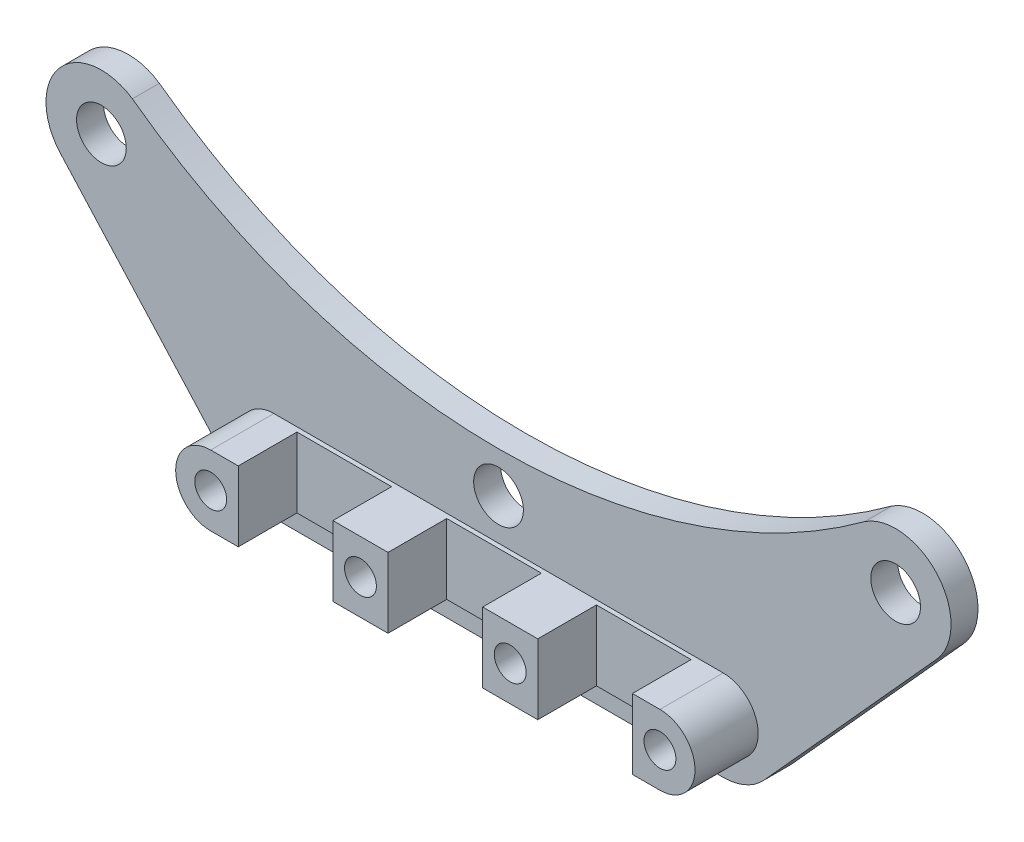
from build123d import *

# Parameters (mm, degrees)
SKETCH1_R             = 2.1082
BOSS_EXTRUDE1_DEPTH   = 2.286
SKETCH3_W             = 8.0264
SKETCH3_H             = 5.9436
SKETCH3_W_2           = 4.6736
BOSS_EXTRUDE2_DEPTH   = 5.3594
F_6_32_TAPPED_HOLE1_D = 2.7051
CUT_EXTRUDE1_START    = -7.6454
SKETCH6_W             = 8.0264
SKETCH6_H             = 5.9436
CUT_EXTRUDE1_DEPTH    = 4.9784


with BuildPart() as part:
    # Sketch1 → Boss-Extrude1 (new body)
    with BuildSketch(Plane.XY):
        with BuildLine():
            ThreePointArc((204.109394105, 67.49162227), (204.422997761, 65.803753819), (205.321949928, 64.341176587))
            Line((205.321949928, 64.341176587), (219.951436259, 48.151439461))
            ThreePointArc((219.951436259, 48.151439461), (221.53044017, 47.007438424), (223.437880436, 46.602885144))
            Line((223.437880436, 46.602885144), (261.537880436, 46.602885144))
            ThreePointArc((261.537880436, 46.602885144), (263.445320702, 47.007438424), (265.024324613, 48.151439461))
            Line((265.024324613, 48.151439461), (279.653810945, 64.341176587))
            ThreePointArc((279.653810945, 64.341176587), (280.552763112, 65.803753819), (280.866366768, 67.49162227))
            ThreePointArc((280.866366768, 67.49162227), (278.373543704, 71.64052385), (273.539963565, 71.387434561))
            ThreePointArc((273.539963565, 71.387434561), (273.4000506, 71.285011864), (273.259799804, 71.183052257))
            ThreePointArc((273.259799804, 71.183052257), (242.487880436, 61.207885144), (211.715961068, 71.183052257))
            ThreePointArc((211.715961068, 71.183052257), (211.575710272, 71.285011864), (211.435797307, 71.387434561))
            ThreePointArc((211.435797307, 71.387434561), (206.602217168, 71.64052385), (204.109394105, 67.49162227))
        make_face()
        with Locations((242.487880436, 57.753485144)):
            Circle(SKETCH1_R, mode=Mode.SUBTRACT)
        with Locations((208.808394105, 67.49162227)):
            Circle(SKETCH1_R, mode=Mode.SUBTRACT)
        with Locations((276.167366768, 67.49162227)):
            Circle(SKETCH1_R, mode=Mode.SUBTRACT)
    extrude(amount=BOSS_EXTRUDE1_DEPTH)

    # Sketch3 → Boss-Extrude2 (add)
    with BuildSketch(Plane.XY.offset(2.286)):
        with BuildLine():
            Line((225.774680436, 54.273685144), (223.437880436, 54.273685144))
            ThreePointArc((223.437880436, 54.273685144), (220.466080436, 51.301885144), (223.437880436, 48.330085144))
            Line((223.437880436, 48.330085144), (225.774680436, 48.330085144))
            Line((225.774680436, 48.330085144), (225.774680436, 54.273685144))
        make_face()
        with Locations((229.787880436, 51.301885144)):
            Rectangle(SKETCH3_W, SKETCH3_H)
        with Locations((236.137880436, 51.301885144)):
            Rectangle(SKETCH3_W_2, SKETCH3_H)
        with Locations((242.487880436, 51.301885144)):
            Rectangle(SKETCH3_W, SKETCH3_H)
        with Locations((248.837880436, 51.301885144)):
            Rectangle(SKETCH3_W_2, SKETCH3_H)
        with Locations((255.187880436, 51.301885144)):
            Rectangle(SKETCH3_W, SKETCH3_H)
        with BuildLine():
            Line((261.537880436, 54.273685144), (259.201080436, 54.273685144))
            Line((259.201080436, 54.273685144), (259.201080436, 48.330085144))
            Line((259.201080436, 48.330085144), (261.537880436, 48.330085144))
            ThreePointArc((261.537880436, 48.330085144), (264.509680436, 51.301885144), (261.537880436, 54.273685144))
        make_face()
    extrude(amount=BOSS_EXTRUDE2_DEPTH)

    # 6-32 Tapped Hole1 (through all)
    with Locations(Plane(origin=(0, 0, 0), x_dir=(-1, 0, 0), z_dir=(0, 0, -1))):
        with Locations((-261.537880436, 51.301885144), (-248.837880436, 51.301885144), (-236.137880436, 51.301885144), (-223.437880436, 51.301885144)):
            Hole(F_6_32_TAPPED_HOLE1_D / 2)

    # Sketch6 → Cut-Extrude1 (cut)
    with BuildSketch(Plane(origin=(0, 0, 0), x_dir=(-1, 0, 0), z_dir=(0, 0, -1)).offset(CUT_EXTRUDE1_START)):
        with Locations((-255.187880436, 51.301885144)):
            Rectangle(SKETCH6_W, SKETCH6_H)
        with Locations((-242.487880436, 51.301885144)):
            Rectangle(SKETCH6_W, SKETCH6_H)
        with Locations((-229.787880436, 51.301885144)):
            Rectangle(SKETCH6_W, SKETCH6_H)
    extrude(amount=CUT_EXTRUDE1_DEPTH, mode=Mode.SUBTRACT)


solid = part.part
